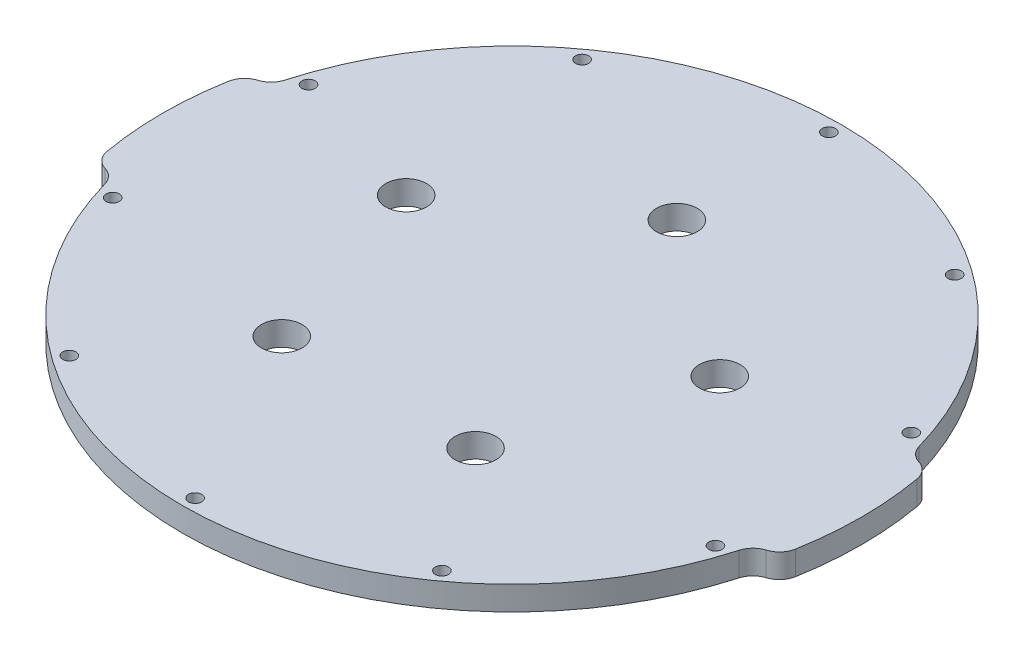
ISO-10303-21;
HEADER;
FILE_DESCRIPTION(('STEP AP214'),'2;1');
FILE_NAME('part.step','',(''),(''),'','','');
FILE_SCHEMA(('AUTOMOTIVE_DESIGN { 1 0 10303 214 1 1 1 1 }'));
ENDSEC;
DATA;
#1=APPLICATION_CONTEXT('core data for automotive mechanical design processes');
#2=APPLICATION_PROTOCOL_DEFINITION('international standard','automotive_design',2000,#1);
#3=PRODUCT_CONTEXT('',#1,'mechanical');
#4=PRODUCT('Part','Part','',(#3));
#5=PRODUCT_RELATED_PRODUCT_CATEGORY('part','',(#4));
#6=PRODUCT_DEFINITION_FORMATION('','',#4);
#7=PRODUCT_DEFINITION_CONTEXT('part definition',#1,'design');
#8=PRODUCT_DEFINITION('design','',#6,#7);
#9=PRODUCT_DEFINITION_SHAPE('','',#8);
#10=(LENGTH_UNIT() NAMED_UNIT(*) SI_UNIT(.MILLI.,.METRE.));
#11=(NAMED_UNIT(*) PLANE_ANGLE_UNIT() SI_UNIT($,.RADIAN.));
#12=(NAMED_UNIT(*) SI_UNIT($,.STERADIAN.) SOLID_ANGLE_UNIT());
#13=UNCERTAINTY_MEASURE_WITH_UNIT(LENGTH_MEASURE(1.E-05),#10,'distance_accuracy_value','');
#14=(GEOMETRIC_REPRESENTATION_CONTEXT(3) GLOBAL_UNCERTAINTY_ASSIGNED_CONTEXT((#13)) GLOBAL_UNIT_ASSIGNED_CONTEXT((#10,
#11,#12)) REPRESENTATION_CONTEXT('',''));
#15=CARTESIAN_POINT('',(0.,0.,0.));
#16=DIRECTION('',(0.,0.,1.));
#17=DIRECTION('',(1.,0.,0.));
#18=AXIS2_PLACEMENT_3D('',#15,#16,#17);
#19=CARTESIAN_POINT('',(-40.6479400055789,6.,-7.16732853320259));
#20=DIRECTION('',(0.,-1.,0.));
#21=DIRECTION('',(0.,0.,-1.));
#22=AXIS2_PLACEMENT_3D('',#19,#20,#21);
#23=PLANE('',#22);
#24=CARTESIAN_POINT('',(-39.2548577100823,6.,-12.7546764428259));
#25=DIRECTION('',(0.,1.,0.));
#26=DIRECTION('',(0.,0.,1.));
#27=AXIS2_PLACEMENT_3D('',#24,#25,#26);
#28=CIRCLE('',#27,5.1);
#29=CARTESIAN_POINT('',(-39.2548577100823,6.,-7.65467644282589));
#30=VERTEX_POINT('',#29);
#31=EDGE_CURVE('E384',#30,#30,#28,.T.);
#32=ORIENTED_EDGE('',*,*,#31,.F.);
#33=EDGE_LOOP('',(#32));
#34=FACE_BOUND('',#33,.T.);
#35=CARTESIAN_POINT('',(-24.2608362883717,6.,33.3921764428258));
#36=DIRECTION('',(0.,1.,0.));
#37=DIRECTION('',(0.,0.,1.));
#38=AXIS2_PLACEMENT_3D('',#35,#36,#37);
#39=CIRCLE('',#38,5.1);
#40=CARTESIAN_POINT('',(-24.2608362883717,6.,38.4921764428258));
#41=VERTEX_POINT('',#40);
#42=EDGE_CURVE('E378',#41,#41,#39,.T.);
#43=ORIENTED_EDGE('',*,*,#42,.F.);
#44=EDGE_LOOP('',(#43));
#45=FACE_BOUND('',#44,.T.);
#46=CARTESIAN_POINT('',(24.2608362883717,6.,33.3921764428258));
#47=DIRECTION('',(0.,1.,0.));
#48=DIRECTION('',(0.,0.,1.));
#49=AXIS2_PLACEMENT_3D('',#46,#47,#48);
#50=CIRCLE('',#49,5.1);
#51=CARTESIAN_POINT('',(24.2608362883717,6.,38.4921764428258));
#52=VERTEX_POINT('',#51);
#53=EDGE_CURVE('E372',#52,#52,#50,.T.);
#54=ORIENTED_EDGE('',*,*,#53,.F.);
#55=EDGE_LOOP('',(#54));
#56=FACE_BOUND('',#55,.T.);
#57=CARTESIAN_POINT('',(39.2548577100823,6.,-12.7546764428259));
#58=DIRECTION('',(0.,1.,0.));
#59=DIRECTION('',(0.,0.,1.));
#60=AXIS2_PLACEMENT_3D('',#57,#58,#59);
#61=CIRCLE('',#60,5.09999999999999);
#62=CARTESIAN_POINT('',(39.2548577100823,6.,-7.65467644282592));
#63=VERTEX_POINT('',#62);
#64=EDGE_CURVE('E366',#63,#63,#61,.T.);
#65=ORIENTED_EDGE('',*,*,#64,.F.);
#66=EDGE_LOOP('',(#65));
#67=FACE_BOUND('',#66,.T.);
#68=CARTESIAN_POINT('',(0.,6.,-41.2749999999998));
#69=DIRECTION('',(0.,1.,0.));
#70=DIRECTION('',(0.,0.,1.));
#71=AXIS2_PLACEMENT_3D('',#68,#69,#70);
#72=CIRCLE('',#71,5.1);
#73=CARTESIAN_POINT('',(0.,6.,-36.1749999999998));
#74=VERTEX_POINT('',#73);
#75=EDGE_CURVE('E360',#74,#74,#72,.T.);
#76=ORIENTED_EDGE('',*,*,#75,.F.);
#77=EDGE_LOOP('',(#76));
#78=FACE_BOUND('',#77,.T.);
#79=CARTESIAN_POINT('',(-75.4663345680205,6.,-24.5204985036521));
#80=DIRECTION('',(0.,1.,0.));
#81=DIRECTION('',(0.,0.,1.));
#82=AXIS2_PLACEMENT_3D('',#79,#80,#81);
#83=CIRCLE('',#82,1.6500000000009);
#84=CARTESIAN_POINT('',(-75.4663345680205,6.,-22.8704985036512));
#85=VERTEX_POINT('',#84);
#86=EDGE_CURVE('E345',#85,#85,#83,.T.);
#87=ORIENTED_EDGE('',*,*,#86,.F.);
#88=EDGE_LOOP('',(#87));
#89=FACE_BOUND('',#88,.T.);
#90=CARTESIAN_POINT('',(-46.6407597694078,6.,64.1954985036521));
#91=DIRECTION('',(0.,1.,0.));
#92=DIRECTION('',(0.,0.,1.));
#93=AXIS2_PLACEMENT_3D('',#90,#91,#92);
#94=CIRCLE('',#93,1.65000000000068);
#95=CARTESIAN_POINT('',(-46.6407597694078,6.,65.8454985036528));
#96=VERTEX_POINT('',#95);
#97=EDGE_CURVE('E333',#96,#96,#94,.T.);
#98=ORIENTED_EDGE('',*,*,#97,.F.);
#99=EDGE_LOOP('',(#98));
#100=FACE_BOUND('',#99,.T.);
#101=CARTESIAN_POINT('',(46.6407597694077,6.,64.1954985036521));
#102=DIRECTION('',(0.,1.,0.));
#103=DIRECTION('',(0.,0.,1.));
#104=AXIS2_PLACEMENT_3D('',#101,#102,#103);
#105=CIRCLE('',#104,1.65000000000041);
#106=CARTESIAN_POINT('',(46.6407597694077,6.,65.8454985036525));
#107=VERTEX_POINT('',#106);
#108=EDGE_CURVE('E321',#107,#107,#105,.T.);
#109=ORIENTED_EDGE('',*,*,#108,.F.);
#110=EDGE_LOOP('',(#109));
#111=FACE_BOUND('',#110,.T.);
#112=CARTESIAN_POINT('',(75.4663345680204,6.,-24.5204985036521));
#113=DIRECTION('',(0.,1.,0.));
#114=DIRECTION('',(0.,0.,1.));
#115=AXIS2_PLACEMENT_3D('',#112,#113,#114);
#116=CIRCLE('',#115,1.65000000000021);
#117=CARTESIAN_POINT('',(75.4663345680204,6.,-22.8704985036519));
#118=VERTEX_POINT('',#117);
#119=EDGE_CURVE('E309',#118,#118,#116,.T.);
#120=ORIENTED_EDGE('',*,*,#119,.F.);
#121=EDGE_LOOP('',(#120));
#122=FACE_BOUND('',#121,.T.);
#123=CARTESIAN_POINT('',(0.,6.,-79.35));
#124=DIRECTION('',(0.,1.,0.));
#125=DIRECTION('',(0.,0.,1.));
#126=AXIS2_PLACEMENT_3D('',#123,#124,#125);
#127=CIRCLE('',#126,1.65);
#128=CARTESIAN_POINT('',(0.,6.,-77.7));
#129=VERTEX_POINT('',#128);
#130=EDGE_CURVE('E277',#129,#129,#127,.T.);
#131=ORIENTED_EDGE('',*,*,#130,.F.);
#132=EDGE_LOOP('',(#131));
#133=FACE_BOUND('',#132,.T.);
#134=CARTESIAN_POINT('',(0.,6.,0.));
#135=DIRECTION('',(0.,1.,0.));
#136=DIRECTION('',(0.,0.,-1.));
#137=AXIS2_PLACEMENT_3D('',#134,#135,#136);
#138=CIRCLE('',#137,82.55);
#139=CARTESIAN_POINT('',(79.4156922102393,6.,-22.5310969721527));
#140=VERTEX_POINT('',#139);
#141=CARTESIAN_POINT('',(-79.4156922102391,6.,-22.531096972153));
#142=VERTEX_POINT('',#141);
#143=EDGE_CURVE('E272',#140,#142,#138,.T.);
#144=ORIENTED_EDGE('',*,*,#143,.T.);
#145=CARTESIAN_POINT('',(-84.2258492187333,6.,-23.8957909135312));
#146=DIRECTION('',(0.,-1.,0.));
#147=DIRECTION('',(0.,0.,-1.));
#148=AXIS2_PLACEMENT_3D('',#145,#146,#147);
#149=CIRCLE('',#148,5.);
#150=CARTESIAN_POINT('',(-82.7608646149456,6.,-19.1152239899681));
#151=VERTEX_POINT('',#150);
#152=EDGE_CURVE('E127',#142,#151,#149,.T.);
#153=ORIENTED_EDGE('',*,*,#152,.T.);
#154=CARTESIAN_POINT('',(-81.2958800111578,6.,-14.3346570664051));
#155=DIRECTION('',(0.,1.,0.));
#156=DIRECTION('',(0.,0.,-1.));
#157=AXIS2_PLACEMENT_3D('',#154,#155,#156);
#158=CIRCLE('',#157,5.00000000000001);
#159=CARTESIAN_POINT('',(-86.2199187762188,6.,-15.2028979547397));
#160=VERTEX_POINT('',#159);
#161=EDGE_CURVE('E120',#151,#160,#158,.T.);
#162=ORIENTED_EDGE('',*,*,#161,.T.);
#163=CARTESIAN_POINT('',(0.,6.,0.));
#164=DIRECTION('',(0.,1.,0.));
#165=DIRECTION('',(0.,0.,-1.));
#166=AXIS2_PLACEMENT_3D('',#163,#164,#165);
#167=CIRCLE('',#166,87.55);
#168=CARTESIAN_POINT('',(-86.2199187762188,6.,15.2028979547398));
#169=VERTEX_POINT('',#168);
#170=EDGE_CURVE('E124',#160,#169,#167,.T.);
#171=ORIENTED_EDGE('',*,*,#170,.T.);
#172=CARTESIAN_POINT('',(-81.2958800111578,6.,14.3346570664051));
#173=DIRECTION('',(0.,1.,0.));
#174=DIRECTION('',(0.,0.,1.));
#175=AXIS2_PLACEMENT_3D('',#172,#173,#174);
#176=CIRCLE('',#175,5.00000000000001);
#177=CARTESIAN_POINT('',(-82.7608646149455,6.,19.1152239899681));
#178=VERTEX_POINT('',#177);
#179=EDGE_CURVE('E140',#169,#178,#176,.T.);
#180=ORIENTED_EDGE('',*,*,#179,.T.);
#181=CARTESIAN_POINT('',(-84.2258492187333,6.,23.8957909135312));
#182=DIRECTION('',(0.,-1.,0.));
#183=DIRECTION('',(0.,0.,-1.));
#184=AXIS2_PLACEMENT_3D('',#181,#182,#183);
#185=CIRCLE('',#184,5.);
#186=CARTESIAN_POINT('',(-79.4156922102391,6.,22.531096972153));
#187=VERTEX_POINT('',#186);
#188=EDGE_CURVE('E11',#178,#187,#185,.T.);
#189=ORIENTED_EDGE('',*,*,#188,.T.);
#190=CARTESIAN_POINT('',(0.,6.,-4.92661467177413E-13));
#191=DIRECTION('',(0.,1.,0.));
#192=DIRECTION('',(0.,0.,-1.));
#193=AXIS2_PLACEMENT_3D('',#190,#191,#192);
#194=CIRCLE('',#193,82.5500000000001);
#195=CARTESIAN_POINT('',(79.4156922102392,6.,22.5310969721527));
#196=VERTEX_POINT('',#195);
#197=EDGE_CURVE('E259',#187,#196,#194,.T.);
#198=ORIENTED_EDGE('',*,*,#197,.T.);
#199=CARTESIAN_POINT('',(84.2258492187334,6.,23.8957909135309));
#200=DIRECTION('',(0.,-1.,0.));
#201=DIRECTION('',(0.,0.,-1.));
#202=AXIS2_PLACEMENT_3D('',#199,#200,#201);
#203=CIRCLE('',#202,5.);
#204=CARTESIAN_POINT('',(82.7608646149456,6.,19.1152239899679));
#205=VERTEX_POINT('',#204);
#206=EDGE_CURVE('E171',#196,#205,#203,.T.);
#207=ORIENTED_EDGE('',*,*,#206,.T.);
#208=CARTESIAN_POINT('',(81.2958800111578,6.,14.3346570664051));
#209=DIRECTION('',(0.,1.,0.));
#210=DIRECTION('',(0.,0.,-1.));
#211=AXIS2_PLACEMENT_3D('',#208,#209,#210);
#212=CIRCLE('',#211,4.99999999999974);
#213=CARTESIAN_POINT('',(86.2199187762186,6.,15.2028979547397));
#214=VERTEX_POINT('',#213);
#215=EDGE_CURVE('E256',#205,#214,#212,.T.);
#216=ORIENTED_EDGE('',*,*,#215,.T.);
#217=CARTESIAN_POINT('',(-1.29063426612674E-12,6.,0.));
#218=DIRECTION('',(0.,1.,0.));
#219=DIRECTION('',(0.,0.,1.));
#220=AXIS2_PLACEMENT_3D('',#217,#218,#219);
#221=CIRCLE('',#220,87.550000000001);
#222=CARTESIAN_POINT('',(86.2199187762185,6.,-15.2028979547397));
#223=VERTEX_POINT('',#222);
#224=EDGE_CURVE('E263',#214,#223,#221,.T.);
#225=ORIENTED_EDGE('',*,*,#224,.T.);
#226=CARTESIAN_POINT('',(81.2958800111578,6.,-14.3346570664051));
#227=DIRECTION('',(0.,1.,0.));
#228=DIRECTION('',(0.,0.,1.));
#229=AXIS2_PLACEMENT_3D('',#226,#227,#228);
#230=CIRCLE('',#229,4.99999999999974);
#231=CARTESIAN_POINT('',(82.7608646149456,6.,-19.1152239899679));
#232=VERTEX_POINT('',#231);
#233=EDGE_CURVE('E265',#223,#232,#230,.T.);
#234=ORIENTED_EDGE('',*,*,#233,.T.);
#235=CARTESIAN_POINT('',(84.2258492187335,6.,-23.8957909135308));
#236=DIRECTION('',(0.,-1.,0.));
#237=DIRECTION('',(0.,0.,-1.));
#238=AXIS2_PLACEMENT_3D('',#235,#236,#237);
#239=CIRCLE('',#238,5.);
#240=EDGE_CURVE('E175',#232,#140,#239,.T.);
#241=ORIENTED_EDGE('',*,*,#240,.T.);
#242=EDGE_LOOP('',(#144,#153,#162,#171,#180,#189,#198,#207,#216,#225,#234,#241));
#243=FACE_BOUND('',#242,.T.);
#244=CARTESIAN_POINT('',(46.6407597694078,6.,-64.1954985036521));
#245=DIRECTION('',(0.,1.,0.));
#246=DIRECTION('',(0.,0.,1.));
#247=AXIS2_PLACEMENT_3D('',#244,#245,#246);
#248=CIRCLE('',#247,1.65000000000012);
#249=CARTESIAN_POINT('',(46.6407597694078,6.,-62.5454985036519));
#250=VERTEX_POINT('',#249);
#251=EDGE_CURVE('E303',#250,#250,#248,.T.);
#252=ORIENTED_EDGE('',*,*,#251,.F.);
#253=EDGE_LOOP('',(#252));
#254=FACE_BOUND('',#253,.T.);
#255=CARTESIAN_POINT('',(75.4663345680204,6.,24.5204985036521));
#256=DIRECTION('',(0.,1.,0.));
#257=DIRECTION('',(0.,0.,1.));
#258=AXIS2_PLACEMENT_3D('',#255,#256,#257);
#259=CIRCLE('',#258,1.65000000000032);
#260=CARTESIAN_POINT('',(75.4663345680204,6.,26.1704985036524));
#261=VERTEX_POINT('',#260);
#262=EDGE_CURVE('E315',#261,#261,#259,.T.);
#263=ORIENTED_EDGE('',*,*,#262,.F.);
#264=EDGE_LOOP('',(#263));
#265=FACE_BOUND('',#264,.T.);
#266=CARTESIAN_POINT('',(0.,6.,79.35));
#267=DIRECTION('',(0.,1.,0.));
#268=DIRECTION('',(0.,0.,1.));
#269=AXIS2_PLACEMENT_3D('',#266,#267,#268);
#270=CIRCLE('',#269,1.65000000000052);
#271=CARTESIAN_POINT('',(0.,6.,81.0000000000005));
#272=VERTEX_POINT('',#271);
#273=EDGE_CURVE('E327',#272,#272,#270,.T.);
#274=ORIENTED_EDGE('',*,*,#273,.F.);
#275=EDGE_LOOP('',(#274));
#276=FACE_BOUND('',#275,.T.);
#277=CARTESIAN_POINT('',(-75.4663345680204,6.,24.5204985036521));
#278=DIRECTION('',(0.,1.,0.));
#279=DIRECTION('',(0.,0.,1.));
#280=AXIS2_PLACEMENT_3D('',#277,#278,#279);
#281=CIRCLE('',#280,1.65000000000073);
#282=CARTESIAN_POINT('',(-75.4663345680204,6.,26.1704985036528));
#283=VERTEX_POINT('',#282);
#284=EDGE_CURVE('E339',#283,#283,#281,.T.);
#285=ORIENTED_EDGE('',*,*,#284,.F.);
#286=EDGE_LOOP('',(#285));
#287=FACE_BOUND('',#286,.T.);
#288=CARTESIAN_POINT('',(-46.6407597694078,6.,-64.1954985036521));
#289=DIRECTION('',(0.,1.,0.));
#290=DIRECTION('',(0.,0.,1.));
#291=AXIS2_PLACEMENT_3D('',#288,#289,#290);
#292=CIRCLE('',#291,1.65000000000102);
#293=CARTESIAN_POINT('',(-46.6407597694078,6.,-62.545498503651));
#294=VERTEX_POINT('',#293);
#295=EDGE_CURVE('E351',#294,#294,#292,.T.);
#296=ORIENTED_EDGE('',*,*,#295,.F.);
#297=EDGE_LOOP('',(#296));
#298=FACE_BOUND('',#297,.T.);
#299=ADVANCED_FACE('F32',(#34,#45,#56,#67,#78,#89,#100,#111,#122,#133,#243,#254,#265,#276,#287,
#298),#23,.F.);
#300=CARTESIAN_POINT('',(-40.6479400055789,0.,-7.16732853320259));
#301=DIRECTION('',(0.,-1.,0.));
#302=DIRECTION('',(0.,0.,-1.));
#303=AXIS2_PLACEMENT_3D('',#300,#301,#302);
#304=PLANE('',#303);
#305=CARTESIAN_POINT('',(-39.2548577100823,0.,-12.7546764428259));
#306=DIRECTION('',(0.,1.,0.));
#307=DIRECTION('',(0.,0.,1.));
#308=AXIS2_PLACEMENT_3D('',#305,#306,#307);
#309=CIRCLE('',#308,5.1);
#310=CARTESIAN_POINT('',(-39.2548577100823,0.,-7.65467644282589));
#311=VERTEX_POINT('',#310);
#312=EDGE_CURVE('E381',#311,#311,#309,.T.);
#313=ORIENTED_EDGE('',*,*,#312,.T.);
#314=EDGE_LOOP('',(#313));
#315=FACE_BOUND('',#314,.T.);
#316=CARTESIAN_POINT('',(-24.2608362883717,0.,33.3921764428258));
#317=DIRECTION('',(0.,1.,0.));
#318=DIRECTION('',(0.,0.,1.));
#319=AXIS2_PLACEMENT_3D('',#316,#317,#318);
#320=CIRCLE('',#319,5.1);
#321=CARTESIAN_POINT('',(-24.2608362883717,0.,38.4921764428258));
#322=VERTEX_POINT('',#321);
#323=EDGE_CURVE('E375',#322,#322,#320,.T.);
#324=ORIENTED_EDGE('',*,*,#323,.T.);
#325=EDGE_LOOP('',(#324));
#326=FACE_BOUND('',#325,.T.);
#327=CARTESIAN_POINT('',(24.2608362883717,0.,33.3921764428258));
#328=DIRECTION('',(0.,1.,0.));
#329=DIRECTION('',(0.,0.,1.));
#330=AXIS2_PLACEMENT_3D('',#327,#328,#329);
#331=CIRCLE('',#330,5.1);
#332=CARTESIAN_POINT('',(24.2608362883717,0.,38.4921764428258));
#333=VERTEX_POINT('',#332);
#334=EDGE_CURVE('E369',#333,#333,#331,.T.);
#335=ORIENTED_EDGE('',*,*,#334,.T.);
#336=EDGE_LOOP('',(#335));
#337=FACE_BOUND('',#336,.T.);
#338=CARTESIAN_POINT('',(39.2548577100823,0.,-12.7546764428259));
#339=DIRECTION('',(0.,1.,0.));
#340=DIRECTION('',(0.,0.,1.));
#341=AXIS2_PLACEMENT_3D('',#338,#339,#340);
#342=CIRCLE('',#341,5.09999999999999);
#343=CARTESIAN_POINT('',(39.2548577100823,0.,-7.65467644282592));
#344=VERTEX_POINT('',#343);
#345=EDGE_CURVE('E363',#344,#344,#342,.T.);
#346=ORIENTED_EDGE('',*,*,#345,.T.);
#347=EDGE_LOOP('',(#346));
#348=FACE_BOUND('',#347,.T.);
#349=CARTESIAN_POINT('',(0.,0.,-41.2749999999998));
#350=DIRECTION('',(0.,1.,0.));
#351=DIRECTION('',(0.,0.,1.));
#352=AXIS2_PLACEMENT_3D('',#349,#350,#351);
#353=CIRCLE('',#352,5.1);
#354=CARTESIAN_POINT('',(0.,0.,-36.1749999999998));
#355=VERTEX_POINT('',#354);
#356=EDGE_CURVE('E357',#355,#355,#353,.T.);
#357=ORIENTED_EDGE('',*,*,#356,.T.);
#358=EDGE_LOOP('',(#357));
#359=FACE_BOUND('',#358,.T.);
#360=CARTESIAN_POINT('',(-75.4663345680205,0.,-24.5204985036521));
#361=DIRECTION('',(0.,1.,0.));
#362=DIRECTION('',(0.,0.,1.));
#363=AXIS2_PLACEMENT_3D('',#360,#361,#362);
#364=CIRCLE('',#363,1.6500000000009);
#365=CARTESIAN_POINT('',(-75.4663345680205,0.,-22.8704985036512));
#366=VERTEX_POINT('',#365);
#367=EDGE_CURVE('E348',#366,#366,#364,.T.);
#368=ORIENTED_EDGE('',*,*,#367,.T.);
#369=EDGE_LOOP('',(#368));
#370=FACE_BOUND('',#369,.T.);
#371=CARTESIAN_POINT('',(-46.6407597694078,0.,64.1954985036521));
#372=DIRECTION('',(0.,1.,0.));
#373=DIRECTION('',(0.,0.,1.));
#374=AXIS2_PLACEMENT_3D('',#371,#372,#373);
#375=CIRCLE('',#374,1.65000000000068);
#376=CARTESIAN_POINT('',(-46.6407597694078,0.,65.8454985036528));
#377=VERTEX_POINT('',#376);
#378=EDGE_CURVE('E336',#377,#377,#375,.T.);
#379=ORIENTED_EDGE('',*,*,#378,.T.);
#380=EDGE_LOOP('',(#379));
#381=FACE_BOUND('',#380,.T.);
#382=CARTESIAN_POINT('',(46.6407597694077,0.,64.1954985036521));
#383=DIRECTION('',(0.,1.,0.));
#384=DIRECTION('',(0.,0.,1.));
#385=AXIS2_PLACEMENT_3D('',#382,#383,#384);
#386=CIRCLE('',#385,1.65000000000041);
#387=CARTESIAN_POINT('',(46.6407597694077,0.,65.8454985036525));
#388=VERTEX_POINT('',#387);
#389=EDGE_CURVE('E324',#388,#388,#386,.T.);
#390=ORIENTED_EDGE('',*,*,#389,.T.);
#391=EDGE_LOOP('',(#390));
#392=FACE_BOUND('',#391,.T.);
#393=CARTESIAN_POINT('',(75.4663345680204,0.,-24.5204985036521));
#394=DIRECTION('',(0.,1.,0.));
#395=DIRECTION('',(0.,0.,1.));
#396=AXIS2_PLACEMENT_3D('',#393,#394,#395);
#397=CIRCLE('',#396,1.65000000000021);
#398=CARTESIAN_POINT('',(75.4663345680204,0.,-22.8704985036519));
#399=VERTEX_POINT('',#398);
#400=EDGE_CURVE('E312',#399,#399,#397,.T.);
#401=ORIENTED_EDGE('',*,*,#400,.T.);
#402=EDGE_LOOP('',(#401));
#403=FACE_BOUND('',#402,.T.);
#404=CARTESIAN_POINT('',(0.,0.,-79.35));
#405=DIRECTION('',(0.,1.,0.));
#406=DIRECTION('',(0.,0.,1.));
#407=AXIS2_PLACEMENT_3D('',#404,#405,#406);
#408=CIRCLE('',#407,1.65);
#409=CARTESIAN_POINT('',(0.,0.,-77.7));
#410=VERTEX_POINT('',#409);
#411=EDGE_CURVE('E300',#410,#410,#408,.T.);
#412=ORIENTED_EDGE('',*,*,#411,.T.);
#413=EDGE_LOOP('',(#412));
#414=FACE_BOUND('',#413,.T.);
#415=CARTESIAN_POINT('',(-81.2958800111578,0.,-14.3346570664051));
#416=DIRECTION('',(0.,1.,0.));
#417=DIRECTION('',(0.,0.,-1.));
#418=AXIS2_PLACEMENT_3D('',#415,#416,#417);
#419=CIRCLE('',#418,5.00000000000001);
#420=CARTESIAN_POINT('',(-82.7608646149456,0.,-19.1152239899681));
#421=VERTEX_POINT('',#420);
#422=CARTESIAN_POINT('',(-86.2199187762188,0.,-15.2028979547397));
#423=VERTEX_POINT('',#422);
#424=EDGE_CURVE('E144',#421,#423,#419,.T.);
#425=ORIENTED_EDGE('',*,*,#424,.F.);
#426=CARTESIAN_POINT('',(-84.2258492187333,0.,-23.8957909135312));
#427=DIRECTION('',(0.,-1.,0.));
#428=DIRECTION('',(0.,0.,-1.));
#429=AXIS2_PLACEMENT_3D('',#426,#427,#428);
#430=CIRCLE('',#429,5.);
#431=CARTESIAN_POINT('',(-79.4156922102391,0.,-22.531096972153));
#432=VERTEX_POINT('',#431);
#433=EDGE_CURVE('E177',#421,#432,#430,.F.);
#434=ORIENTED_EDGE('',*,*,#433,.T.);
#435=CARTESIAN_POINT('',(0.,0.,0.));
#436=DIRECTION('',(0.,1.,0.));
#437=DIRECTION('',(0.,0.,-1.));
#438=AXIS2_PLACEMENT_3D('',#435,#436,#437);
#439=CIRCLE('',#438,82.55);
#440=CARTESIAN_POINT('',(79.4156922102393,0.,-22.5310969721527));
#441=VERTEX_POINT('',#440);
#442=EDGE_CURVE('E132',#441,#432,#439,.T.);
#443=ORIENTED_EDGE('',*,*,#442,.F.);
#444=CARTESIAN_POINT('',(84.2258492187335,0.,-23.8957909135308));
#445=DIRECTION('',(0.,-1.,0.));
#446=DIRECTION('',(0.,0.,-1.));
#447=AXIS2_PLACEMENT_3D('',#444,#445,#446);
#448=CIRCLE('',#447,5.);
#449=CARTESIAN_POINT('',(82.7608646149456,0.,-19.1152239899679));
#450=VERTEX_POINT('',#449);
#451=EDGE_CURVE('E173',#441,#450,#448,.F.);
#452=ORIENTED_EDGE('',*,*,#451,.T.);
#453=CARTESIAN_POINT('',(81.2958800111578,0.,-14.3346570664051));
#454=DIRECTION('',(0.,1.,0.));
#455=DIRECTION('',(0.,0.,1.));
#456=AXIS2_PLACEMENT_3D('',#453,#454,#455);
#457=CIRCLE('',#456,4.99999999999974);
#458=CARTESIAN_POINT('',(86.2199187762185,0.,-15.2028979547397));
#459=VERTEX_POINT('',#458);
#460=EDGE_CURVE('E189',#459,#450,#457,.T.);
#461=ORIENTED_EDGE('',*,*,#460,.F.);
#462=CARTESIAN_POINT('',(-1.29063426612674E-12,0.,0.));
#463=DIRECTION('',(0.,1.,0.));
#464=DIRECTION('',(0.,0.,1.));
#465=AXIS2_PLACEMENT_3D('',#462,#463,#464);
#466=CIRCLE('',#465,87.550000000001);
#467=CARTESIAN_POINT('',(86.2199187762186,0.,15.2028979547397));
#468=VERTEX_POINT('',#467);
#469=EDGE_CURVE('E286',#468,#459,#466,.T.);
#470=ORIENTED_EDGE('',*,*,#469,.F.);
#471=CARTESIAN_POINT('',(81.2958800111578,0.,14.3346570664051));
#472=DIRECTION('',(0.,1.,0.));
#473=DIRECTION('',(0.,0.,-1.));
#474=AXIS2_PLACEMENT_3D('',#471,#472,#473);
#475=CIRCLE('',#474,4.99999999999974);
#476=CARTESIAN_POINT('',(82.7608646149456,0.,19.1152239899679));
#477=VERTEX_POINT('',#476);
#478=EDGE_CURVE('E284',#477,#468,#475,.T.);
#479=ORIENTED_EDGE('',*,*,#478,.F.);
#480=CARTESIAN_POINT('',(84.2258492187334,0.,23.8957909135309));
#481=DIRECTION('',(0.,-1.,0.));
#482=DIRECTION('',(0.,0.,-1.));
#483=AXIS2_PLACEMENT_3D('',#480,#481,#482);
#484=CIRCLE('',#483,5.);
#485=CARTESIAN_POINT('',(79.4156922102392,0.,22.5310969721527));
#486=VERTEX_POINT('',#485);
#487=EDGE_CURVE('E169',#477,#486,#484,.F.);
#488=ORIENTED_EDGE('',*,*,#487,.T.);
#489=CARTESIAN_POINT('',(0.,0.,-4.92661467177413E-13));
#490=DIRECTION('',(0.,1.,0.));
#491=DIRECTION('',(0.,0.,-1.));
#492=AXIS2_PLACEMENT_3D('',#489,#490,#491);
#493=CIRCLE('',#492,82.5500000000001);
#494=CARTESIAN_POINT('',(-79.4156922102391,0.,22.531096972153));
#495=VERTEX_POINT('',#494);
#496=EDGE_CURVE('E281',#495,#486,#493,.T.);
#497=ORIENTED_EDGE('',*,*,#496,.F.);
#498=CARTESIAN_POINT('',(-84.2258492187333,0.,23.8957909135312));
#499=DIRECTION('',(0.,-1.,0.));
#500=DIRECTION('',(0.,0.,-1.));
#501=AXIS2_PLACEMENT_3D('',#498,#499,#500);
#502=CIRCLE('',#501,5.);
#503=CARTESIAN_POINT('',(-82.7608646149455,0.,19.1152239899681));
#504=VERTEX_POINT('',#503);
#505=EDGE_CURVE('E40',#495,#504,#502,.F.);
#506=ORIENTED_EDGE('',*,*,#505,.T.);
#507=CARTESIAN_POINT('',(-81.2958800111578,0.,14.3346570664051));
#508=DIRECTION('',(0.,1.,0.));
#509=DIRECTION('',(0.,0.,1.));
#510=AXIS2_PLACEMENT_3D('',#507,#508,#509);
#511=CIRCLE('',#510,5.00000000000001);
#512=CARTESIAN_POINT('',(-86.2199187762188,0.,15.2028979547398));
#513=VERTEX_POINT('',#512);
#514=EDGE_CURVE('E279',#513,#504,#511,.T.);
#515=ORIENTED_EDGE('',*,*,#514,.F.);
#516=CARTESIAN_POINT('',(0.,0.,0.));
#517=DIRECTION('',(0.,1.,0.));
#518=DIRECTION('',(0.,0.,-1.));
#519=AXIS2_PLACEMENT_3D('',#516,#517,#518);
#520=CIRCLE('',#519,87.55);
#521=EDGE_CURVE('E276',#423,#513,#520,.T.);
#522=ORIENTED_EDGE('',*,*,#521,.F.);
#523=EDGE_LOOP('',(#425,#434,#443,#452,#461,#470,#479,#488,#497,#506,#515,#522));
#524=FACE_BOUND('',#523,.T.);
#525=CARTESIAN_POINT('',(46.6407597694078,0.,-64.1954985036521));
#526=DIRECTION('',(0.,1.,0.));
#527=DIRECTION('',(0.,0.,1.));
#528=AXIS2_PLACEMENT_3D('',#525,#526,#527);
#529=CIRCLE('',#528,1.65000000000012);
#530=CARTESIAN_POINT('',(46.6407597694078,0.,-62.5454985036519));
#531=VERTEX_POINT('',#530);
#532=EDGE_CURVE('E306',#531,#531,#529,.T.);
#533=ORIENTED_EDGE('',*,*,#532,.T.);
#534=EDGE_LOOP('',(#533));
#535=FACE_BOUND('',#534,.T.);
#536=CARTESIAN_POINT('',(75.4663345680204,0.,24.5204985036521));
#537=DIRECTION('',(0.,1.,0.));
#538=DIRECTION('',(0.,0.,1.));
#539=AXIS2_PLACEMENT_3D('',#536,#537,#538);
#540=CIRCLE('',#539,1.65000000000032);
#541=CARTESIAN_POINT('',(75.4663345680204,0.,26.1704985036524));
#542=VERTEX_POINT('',#541);
#543=EDGE_CURVE('E318',#542,#542,#540,.T.);
#544=ORIENTED_EDGE('',*,*,#543,.T.);
#545=EDGE_LOOP('',(#544));
#546=FACE_BOUND('',#545,.T.);
#547=CARTESIAN_POINT('',(0.,0.,79.35));
#548=DIRECTION('',(0.,1.,0.));
#549=DIRECTION('',(0.,0.,1.));
#550=AXIS2_PLACEMENT_3D('',#547,#548,#549);
#551=CIRCLE('',#550,1.65000000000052);
#552=CARTESIAN_POINT('',(0.,0.,81.0000000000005));
#553=VERTEX_POINT('',#552);
#554=EDGE_CURVE('E330',#553,#553,#551,.T.);
#555=ORIENTED_EDGE('',*,*,#554,.T.);
#556=EDGE_LOOP('',(#555));
#557=FACE_BOUND('',#556,.T.);
#558=CARTESIAN_POINT('',(-75.4663345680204,0.,24.5204985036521));
#559=DIRECTION('',(0.,1.,0.));
#560=DIRECTION('',(0.,0.,1.));
#561=AXIS2_PLACEMENT_3D('',#558,#559,#560);
#562=CIRCLE('',#561,1.65000000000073);
#563=CARTESIAN_POINT('',(-75.4663345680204,0.,26.1704985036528));
#564=VERTEX_POINT('',#563);
#565=EDGE_CURVE('E342',#564,#564,#562,.T.);
#566=ORIENTED_EDGE('',*,*,#565,.T.);
#567=EDGE_LOOP('',(#566));
#568=FACE_BOUND('',#567,.T.);
#569=CARTESIAN_POINT('',(-46.6407597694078,0.,-64.1954985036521));
#570=DIRECTION('',(0.,1.,0.));
#571=DIRECTION('',(0.,0.,1.));
#572=AXIS2_PLACEMENT_3D('',#569,#570,#571);
#573=CIRCLE('',#572,1.65000000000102);
#574=CARTESIAN_POINT('',(-46.6407597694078,0.,-62.545498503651));
#575=VERTEX_POINT('',#574);
#576=EDGE_CURVE('E354',#575,#575,#573,.T.);
#577=ORIENTED_EDGE('',*,*,#576,.T.);
#578=EDGE_LOOP('',(#577));
#579=FACE_BOUND('',#578,.T.);
#580=ADVANCED_FACE('F181',(#315,#326,#337,#348,#359,#370,#381,#392,#403,#414,#524,#535,#546,
#557,#568,#579),#304,.T.);
#581=CARTESIAN_POINT('',(-81.2958800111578,6.,-14.3346570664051));
#582=DIRECTION('',(0.,-1.,0.));
#583=DIRECTION('',(0.,0.,-1.));
#584=AXIS2_PLACEMENT_3D('',#581,#582,#583);
#585=CYLINDRICAL_SURFACE('',#584,5.00000000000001);
#586=ORIENTED_EDGE('',*,*,#161,.F.);
#587=DIRECTION('',(0.,-1.,0.));
#588=VECTOR('',#587,1.);
#589=CARTESIAN_POINT('',(-82.7608646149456,6.,-19.1152239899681));
#590=LINE('',#589,#588);
#591=EDGE_CURVE('E166',#151,#421,#590,.T.);
#592=ORIENTED_EDGE('',*,*,#591,.T.);
#593=ORIENTED_EDGE('',*,*,#424,.T.);
#594=DIRECTION('',(0.,-1.,0.));
#595=VECTOR('',#594,1.);
#596=CARTESIAN_POINT('',(-86.2199187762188,6.,-15.2028979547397));
#597=LINE('',#596,#595);
#598=EDGE_CURVE('E137',#160,#423,#597,.T.);
#599=ORIENTED_EDGE('',*,*,#598,.F.);
#600=EDGE_LOOP('',(#586,#592,#593,#599));
#601=FACE_BOUND('',#600,.T.);
#602=ADVANCED_FACE('F142',(#601),#585,.T.);
#603=CARTESIAN_POINT('',(0.,6.,0.));
#604=DIRECTION('',(0.,-1.,0.));
#605=DIRECTION('',(0.,0.,-1.));
#606=AXIS2_PLACEMENT_3D('',#603,#604,#605);
#607=CYLINDRICAL_SURFACE('',#606,87.55);
#608=ORIENTED_EDGE('',*,*,#521,.T.);
#609=DIRECTION('',(0.,-1.,0.));
#610=VECTOR('',#609,1.);
#611=CARTESIAN_POINT('',(-86.2199187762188,6.,15.2028979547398));
#612=LINE('',#611,#610);
#613=EDGE_CURVE('E139',#169,#513,#612,.T.);
#614=ORIENTED_EDGE('',*,*,#613,.F.);
#615=ORIENTED_EDGE('',*,*,#170,.F.);
#616=ORIENTED_EDGE('',*,*,#598,.T.);
#617=EDGE_LOOP('',(#608,#614,#615,#616));
#618=FACE_BOUND('',#617,.T.);
#619=ADVANCED_FACE('F136',(#618),#607,.T.);
#620=CARTESIAN_POINT('',(-81.2958800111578,6.,14.3346570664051));
#621=DIRECTION('',(0.,-1.,0.));
#622=DIRECTION('',(0.,0.,-1.));
#623=AXIS2_PLACEMENT_3D('',#620,#621,#622);
#624=CYLINDRICAL_SURFACE('',#623,5.00000000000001);
#625=ORIENTED_EDGE('',*,*,#514,.T.);
#626=DIRECTION('',(0.,-1.,0.));
#627=VECTOR('',#626,1.);
#628=CARTESIAN_POINT('',(-82.7608646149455,6.,19.1152239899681));
#629=LINE('',#628,#627);
#630=EDGE_CURVE('E47',#504,#178,#629,.F.);
#631=ORIENTED_EDGE('',*,*,#630,.T.);
#632=ORIENTED_EDGE('',*,*,#179,.F.);
#633=ORIENTED_EDGE('',*,*,#613,.T.);
#634=EDGE_LOOP('',(#625,#631,#632,#633));
#635=FACE_BOUND('',#634,.T.);
#636=ADVANCED_FACE('F234',(#635),#624,.T.);
#637=CARTESIAN_POINT('',(0.,6.,-4.92661467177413E-13));
#638=DIRECTION('',(0.,-1.,0.));
#639=DIRECTION('',(0.,0.,-1.));
#640=AXIS2_PLACEMENT_3D('',#637,#638,#639);
#641=CYLINDRICAL_SURFACE('',#640,82.5500000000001);
#642=ORIENTED_EDGE('',*,*,#496,.T.);
#643=DIRECTION('',(0.,-1.,0.));
#644=VECTOR('',#643,1.);
#645=CARTESIAN_POINT('',(79.4156922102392,6.,22.5310969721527));
#646=LINE('',#645,#644);
#647=EDGE_CURVE('E157',#486,#196,#646,.F.);
#648=ORIENTED_EDGE('',*,*,#647,.T.);
#649=ORIENTED_EDGE('',*,*,#197,.F.);
#650=DIRECTION('',(0.,-1.,0.));
#651=VECTOR('',#650,1.);
#652=CARTESIAN_POINT('',(-79.4156922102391,6.,22.531096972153));
#653=LINE('',#652,#651);
#654=EDGE_CURVE('E149',#187,#495,#653,.T.);
#655=ORIENTED_EDGE('',*,*,#654,.T.);
#656=EDGE_LOOP('',(#642,#648,#649,#655));
#657=FACE_BOUND('',#656,.T.);
#658=ADVANCED_FACE('F230',(#657),#641,.T.);
#659=CARTESIAN_POINT('',(81.2958800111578,6.,14.3346570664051));
#660=DIRECTION('',(0.,-1.,0.));
#661=DIRECTION('',(0.,0.,-1.));
#662=AXIS2_PLACEMENT_3D('',#659,#660,#661);
#663=CYLINDRICAL_SURFACE('',#662,4.99999999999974);
#664=ORIENTED_EDGE('',*,*,#215,.F.);
#665=DIRECTION('',(0.,-1.,0.));
#666=VECTOR('',#665,1.);
#667=CARTESIAN_POINT('',(82.7608646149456,6.,19.1152239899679));
#668=LINE('',#667,#666);
#669=EDGE_CURVE('E146',#205,#477,#668,.T.);
#670=ORIENTED_EDGE('',*,*,#669,.T.);
#671=ORIENTED_EDGE('',*,*,#478,.T.);
#672=DIRECTION('',(0.,-1.,0.));
#673=VECTOR('',#672,1.);
#674=CARTESIAN_POINT('',(86.2199187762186,6.,15.2028979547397));
#675=LINE('',#674,#673);
#676=EDGE_CURVE('E151',#214,#468,#675,.T.);
#677=ORIENTED_EDGE('',*,*,#676,.F.);
#678=EDGE_LOOP('',(#664,#670,#671,#677));
#679=FACE_BOUND('',#678,.T.);
#680=ADVANCED_FACE('F226',(#679),#663,.T.);
#681=CARTESIAN_POINT('',(-1.29063426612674E-12,6.,0.));
#682=DIRECTION('',(0.,-1.,0.));
#683=DIRECTION('',(0.,0.,-1.));
#684=AXIS2_PLACEMENT_3D('',#681,#682,#683);
#685=CYLINDRICAL_SURFACE('',#684,87.550000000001);
#686=ORIENTED_EDGE('',*,*,#469,.T.);
#687=DIRECTION('',(0.,-1.,0.));
#688=VECTOR('',#687,1.);
#689=CARTESIAN_POINT('',(86.2199187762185,6.,-15.2028979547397));
#690=LINE('',#689,#688);
#691=EDGE_CURVE('E274',#223,#459,#690,.T.);
#692=ORIENTED_EDGE('',*,*,#691,.F.);
#693=ORIENTED_EDGE('',*,*,#224,.F.);
#694=ORIENTED_EDGE('',*,*,#676,.T.);
#695=EDGE_LOOP('',(#686,#692,#693,#694));
#696=FACE_BOUND('',#695,.T.);
#697=ADVANCED_FACE('F222',(#696),#685,.T.);
#698=CARTESIAN_POINT('',(81.2958800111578,6.,-14.3346570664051));
#699=DIRECTION('',(0.,-1.,0.));
#700=DIRECTION('',(0.,0.,-1.));
#701=AXIS2_PLACEMENT_3D('',#698,#699,#700);
#702=CYLINDRICAL_SURFACE('',#701,4.99999999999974);
#703=ORIENTED_EDGE('',*,*,#460,.T.);
#704=DIRECTION('',(0.,-1.,0.));
#705=VECTOR('',#704,1.);
#706=CARTESIAN_POINT('',(82.7608646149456,6.,-19.1152239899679));
#707=LINE('',#706,#705);
#708=EDGE_CURVE('E164',#450,#232,#707,.F.);
#709=ORIENTED_EDGE('',*,*,#708,.T.);
#710=ORIENTED_EDGE('',*,*,#233,.F.);
#711=ORIENTED_EDGE('',*,*,#691,.T.);
#712=EDGE_LOOP('',(#703,#709,#710,#711));
#713=FACE_BOUND('',#712,.T.);
#714=ADVANCED_FACE('F219',(#713),#702,.T.);
#715=CARTESIAN_POINT('',(0.,6.,0.));
#716=DIRECTION('',(0.,-1.,0.));
#717=DIRECTION('',(0.,0.,-1.));
#718=AXIS2_PLACEMENT_3D('',#715,#716,#717);
#719=CYLINDRICAL_SURFACE('',#718,82.55);
#720=ORIENTED_EDGE('',*,*,#143,.F.);
#721=DIRECTION('',(0.,-1.,0.));
#722=VECTOR('',#721,1.);
#723=CARTESIAN_POINT('',(79.4156922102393,6.,-22.5310969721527));
#724=LINE('',#723,#722);
#725=EDGE_CURVE('E161',#140,#441,#724,.T.);
#726=ORIENTED_EDGE('',*,*,#725,.T.);
#727=ORIENTED_EDGE('',*,*,#442,.T.);
#728=DIRECTION('',(0.,-1.,0.));
#729=VECTOR('',#728,1.);
#730=CARTESIAN_POINT('',(-79.4156922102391,6.,-22.531096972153));
#731=LINE('',#730,#729);
#732=EDGE_CURVE('E159',#432,#142,#731,.F.);
#733=ORIENTED_EDGE('',*,*,#732,.T.);
#734=EDGE_LOOP('',(#720,#726,#727,#733));
#735=FACE_BOUND('',#734,.T.);
#736=ADVANCED_FACE('F187',(#735),#719,.T.);
#737=CARTESIAN_POINT('',(0.,6.,-79.35));
#738=DIRECTION('',(0.,-1.,0.));
#739=DIRECTION('',(0.,0.,-1.));
#740=AXIS2_PLACEMENT_3D('',#737,#738,#739);
#741=CYLINDRICAL_SURFACE('',#740,1.65);
#742=ORIENTED_EDGE('',*,*,#130,.T.);
#743=EDGE_LOOP('',(#742));
#744=FACE_BOUND('',#743,.T.);
#745=ORIENTED_EDGE('',*,*,#411,.F.);
#746=EDGE_LOOP('',(#745));
#747=FACE_BOUND('',#746,.T.);
#748=ADVANCED_FACE('F214',(#744,#747),#741,.F.);
#749=CARTESIAN_POINT('',(46.6407597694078,6.,-64.1954985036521));
#750=DIRECTION('',(0.,-1.,0.));
#751=DIRECTION('',(0.,0.,-1.));
#752=AXIS2_PLACEMENT_3D('',#749,#750,#751);
#753=CYLINDRICAL_SURFACE('',#752,1.65000000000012);
#754=ORIENTED_EDGE('',*,*,#251,.T.);
#755=EDGE_LOOP('',(#754));
#756=FACE_BOUND('',#755,.T.);
#757=ORIENTED_EDGE('',*,*,#532,.F.);
#758=EDGE_LOOP('',(#757));
#759=FACE_BOUND('',#758,.T.);
#760=ADVANCED_FACE('F438',(#756,#759),#753,.F.);
#761=CARTESIAN_POINT('',(75.4663345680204,6.,-24.5204985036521));
#762=DIRECTION('',(0.,-1.,0.));
#763=DIRECTION('',(0.,0.,-1.));
#764=AXIS2_PLACEMENT_3D('',#761,#762,#763);
#765=CYLINDRICAL_SURFACE('',#764,1.65000000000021);
#766=ORIENTED_EDGE('',*,*,#119,.T.);
#767=EDGE_LOOP('',(#766));
#768=FACE_BOUND('',#767,.T.);
#769=ORIENTED_EDGE('',*,*,#400,.F.);
#770=EDGE_LOOP('',(#769));
#771=FACE_BOUND('',#770,.T.);
#772=ADVANCED_FACE('F435',(#768,#771),#765,.F.);
#773=CARTESIAN_POINT('',(75.4663345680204,6.,24.5204985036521));
#774=DIRECTION('',(0.,-1.,0.));
#775=DIRECTION('',(0.,0.,-1.));
#776=AXIS2_PLACEMENT_3D('',#773,#774,#775);
#777=CYLINDRICAL_SURFACE('',#776,1.65000000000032);
#778=ORIENTED_EDGE('',*,*,#262,.T.);
#779=EDGE_LOOP('',(#778));
#780=FACE_BOUND('',#779,.T.);
#781=ORIENTED_EDGE('',*,*,#543,.F.);
#782=EDGE_LOOP('',(#781));
#783=FACE_BOUND('',#782,.T.);
#784=ADVANCED_FACE('F431',(#780,#783),#777,.F.);
#785=CARTESIAN_POINT('',(46.6407597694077,6.,64.1954985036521));
#786=DIRECTION('',(0.,-1.,0.));
#787=DIRECTION('',(0.,0.,-1.));
#788=AXIS2_PLACEMENT_3D('',#785,#786,#787);
#789=CYLINDRICAL_SURFACE('',#788,1.65000000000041);
#790=ORIENTED_EDGE('',*,*,#108,.T.);
#791=EDGE_LOOP('',(#790));
#792=FACE_BOUND('',#791,.T.);
#793=ORIENTED_EDGE('',*,*,#389,.F.);
#794=EDGE_LOOP('',(#793));
#795=FACE_BOUND('',#794,.T.);
#796=ADVANCED_FACE('F427',(#792,#795),#789,.F.);
#797=CARTESIAN_POINT('',(0.,6.,79.35));
#798=DIRECTION('',(0.,-1.,0.));
#799=DIRECTION('',(0.,0.,-1.));
#800=AXIS2_PLACEMENT_3D('',#797,#798,#799);
#801=CYLINDRICAL_SURFACE('',#800,1.65000000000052);
#802=ORIENTED_EDGE('',*,*,#273,.T.);
#803=EDGE_LOOP('',(#802));
#804=FACE_BOUND('',#803,.T.);
#805=ORIENTED_EDGE('',*,*,#554,.F.);
#806=EDGE_LOOP('',(#805));
#807=FACE_BOUND('',#806,.T.);
#808=ADVANCED_FACE('F423',(#804,#807),#801,.F.);
#809=CARTESIAN_POINT('',(-46.6407597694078,6.,64.1954985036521));
#810=DIRECTION('',(0.,-1.,0.));
#811=DIRECTION('',(0.,0.,-1.));
#812=AXIS2_PLACEMENT_3D('',#809,#810,#811);
#813=CYLINDRICAL_SURFACE('',#812,1.65000000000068);
#814=ORIENTED_EDGE('',*,*,#97,.T.);
#815=EDGE_LOOP('',(#814));
#816=FACE_BOUND('',#815,.T.);
#817=ORIENTED_EDGE('',*,*,#378,.F.);
#818=EDGE_LOOP('',(#817));
#819=FACE_BOUND('',#818,.T.);
#820=ADVANCED_FACE('F419',(#816,#819),#813,.F.);
#821=CARTESIAN_POINT('',(-75.4663345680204,6.,24.5204985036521));
#822=DIRECTION('',(0.,-1.,0.));
#823=DIRECTION('',(0.,0.,-1.));
#824=AXIS2_PLACEMENT_3D('',#821,#822,#823);
#825=CYLINDRICAL_SURFACE('',#824,1.65000000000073);
#826=ORIENTED_EDGE('',*,*,#284,.T.);
#827=EDGE_LOOP('',(#826));
#828=FACE_BOUND('',#827,.T.);
#829=ORIENTED_EDGE('',*,*,#565,.F.);
#830=EDGE_LOOP('',(#829));
#831=FACE_BOUND('',#830,.T.);
#832=ADVANCED_FACE('F415',(#828,#831),#825,.F.);
#833=CARTESIAN_POINT('',(-75.4663345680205,6.,-24.5204985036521));
#834=DIRECTION('',(0.,-1.,0.));
#835=DIRECTION('',(0.,0.,-1.));
#836=AXIS2_PLACEMENT_3D('',#833,#834,#835);
#837=CYLINDRICAL_SURFACE('',#836,1.6500000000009);
#838=ORIENTED_EDGE('',*,*,#86,.T.);
#839=EDGE_LOOP('',(#838));
#840=FACE_BOUND('',#839,.T.);
#841=ORIENTED_EDGE('',*,*,#367,.F.);
#842=EDGE_LOOP('',(#841));
#843=FACE_BOUND('',#842,.T.);
#844=ADVANCED_FACE('F248',(#840,#843),#837,.F.);
#845=CARTESIAN_POINT('',(-46.6407597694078,6.,-64.1954985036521));
#846=DIRECTION('',(0.,-1.,0.));
#847=DIRECTION('',(0.,0.,-1.));
#848=AXIS2_PLACEMENT_3D('',#845,#846,#847);
#849=CYLINDRICAL_SURFACE('',#848,1.65000000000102);
#850=ORIENTED_EDGE('',*,*,#295,.T.);
#851=EDGE_LOOP('',(#850));
#852=FACE_BOUND('',#851,.T.);
#853=ORIENTED_EDGE('',*,*,#576,.F.);
#854=EDGE_LOOP('',(#853));
#855=FACE_BOUND('',#854,.T.);
#856=ADVANCED_FACE('F243',(#852,#855),#849,.F.);
#857=CARTESIAN_POINT('',(84.2258492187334,6.,23.8957909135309));
#858=DIRECTION('',(0.,1.,0.));
#859=DIRECTION('',(0.,0.,1.));
#860=AXIS2_PLACEMENT_3D('',#857,#858,#859);
#861=CYLINDRICAL_SURFACE('',#860,5.);
#862=ORIENTED_EDGE('',*,*,#206,.F.);
#863=ORIENTED_EDGE('',*,*,#647,.F.);
#864=ORIENTED_EDGE('',*,*,#487,.F.);
#865=ORIENTED_EDGE('',*,*,#669,.F.);
#866=EDGE_LOOP('',(#862,#863,#864,#865));
#867=FACE_BOUND('',#866,.T.);
#868=ADVANCED_FACE('F200',(#867),#861,.F.);
#869=CARTESIAN_POINT('',(84.2258492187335,6.,-23.8957909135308));
#870=DIRECTION('',(0.,1.,0.));
#871=DIRECTION('',(0.,0.,1.));
#872=AXIS2_PLACEMENT_3D('',#869,#870,#871);
#873=CYLINDRICAL_SURFACE('',#872,5.);
#874=ORIENTED_EDGE('',*,*,#240,.F.);
#875=ORIENTED_EDGE('',*,*,#708,.F.);
#876=ORIENTED_EDGE('',*,*,#451,.F.);
#877=ORIENTED_EDGE('',*,*,#725,.F.);
#878=EDGE_LOOP('',(#874,#875,#876,#877));
#879=FACE_BOUND('',#878,.T.);
#880=ADVANCED_FACE('F193',(#879),#873,.F.);
#881=CARTESIAN_POINT('',(-84.2258492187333,6.,-23.8957909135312));
#882=DIRECTION('',(0.,1.,0.));
#883=DIRECTION('',(0.,0.,1.));
#884=AXIS2_PLACEMENT_3D('',#881,#882,#883);
#885=CYLINDRICAL_SURFACE('',#884,5.);
#886=ORIENTED_EDGE('',*,*,#152,.F.);
#887=ORIENTED_EDGE('',*,*,#732,.F.);
#888=ORIENTED_EDGE('',*,*,#433,.F.);
#889=ORIENTED_EDGE('',*,*,#591,.F.);
#890=EDGE_LOOP('',(#886,#887,#888,#889));
#891=FACE_BOUND('',#890,.T.);
#892=ADVANCED_FACE('F191',(#891),#885,.F.);
#893=CARTESIAN_POINT('',(-84.2258492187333,6.,23.8957909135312));
#894=DIRECTION('',(0.,1.,0.));
#895=DIRECTION('',(0.,0.,1.));
#896=AXIS2_PLACEMENT_3D('',#893,#894,#895);
#897=CYLINDRICAL_SURFACE('',#896,5.);
#898=ORIENTED_EDGE('',*,*,#188,.F.);
#899=ORIENTED_EDGE('',*,*,#630,.F.);
#900=ORIENTED_EDGE('',*,*,#505,.F.);
#901=ORIENTED_EDGE('',*,*,#654,.F.);
#902=EDGE_LOOP('',(#898,#899,#900,#901));
#903=FACE_BOUND('',#902,.T.);
#904=ADVANCED_FACE('F34',(#903),#897,.F.);
#905=CARTESIAN_POINT('',(0.,0.,-41.2749999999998));
#906=DIRECTION('',(0.,1.,0.));
#907=DIRECTION('',(0.,0.,1.));
#908=AXIS2_PLACEMENT_3D('',#905,#906,#907);
#909=CYLINDRICAL_SURFACE('',#908,5.1);
#910=ORIENTED_EDGE('',*,*,#356,.F.);
#911=EDGE_LOOP('',(#910));
#912=FACE_BOUND('',#911,.T.);
#913=ORIENTED_EDGE('',*,*,#75,.T.);
#914=EDGE_LOOP('',(#913));
#915=FACE_BOUND('',#914,.T.);
#916=ADVANCED_FACE('F198',(#912,#915),#909,.F.);
#917=CARTESIAN_POINT('',(39.2548577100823,0.,-12.7546764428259));
#918=DIRECTION('',(0.,1.,0.));
#919=DIRECTION('',(0.,0.,1.));
#920=AXIS2_PLACEMENT_3D('',#917,#918,#919);
#921=CYLINDRICAL_SURFACE('',#920,5.09999999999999);
#922=ORIENTED_EDGE('',*,*,#345,.F.);
#923=EDGE_LOOP('',(#922));
#924=FACE_BOUND('',#923,.T.);
#925=ORIENTED_EDGE('',*,*,#64,.T.);
#926=EDGE_LOOP('',(#925));
#927=FACE_BOUND('',#926,.T.);
#928=ADVANCED_FACE('F405',(#924,#927),#921,.F.);
#929=CARTESIAN_POINT('',(24.2608362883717,0.,33.3921764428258));
#930=DIRECTION('',(0.,1.,0.));
#931=DIRECTION('',(0.,0.,1.));
#932=AXIS2_PLACEMENT_3D('',#929,#930,#931);
#933=CYLINDRICAL_SURFACE('',#932,5.1);
#934=ORIENTED_EDGE('',*,*,#334,.F.);
#935=EDGE_LOOP('',(#934));
#936=FACE_BOUND('',#935,.T.);
#937=ORIENTED_EDGE('',*,*,#53,.T.);
#938=EDGE_LOOP('',(#937));
#939=FACE_BOUND('',#938,.T.);
#940=ADVANCED_FACE('F399',(#936,#939),#933,.F.);
#941=CARTESIAN_POINT('',(-24.2608362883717,0.,33.3921764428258));
#942=DIRECTION('',(0.,1.,0.));
#943=DIRECTION('',(0.,0.,1.));
#944=AXIS2_PLACEMENT_3D('',#941,#942,#943);
#945=CYLINDRICAL_SURFACE('',#944,5.1);
#946=ORIENTED_EDGE('',*,*,#323,.F.);
#947=EDGE_LOOP('',(#946));
#948=FACE_BOUND('',#947,.T.);
#949=ORIENTED_EDGE('',*,*,#42,.T.);
#950=EDGE_LOOP('',(#949));
#951=FACE_BOUND('',#950,.T.);
#952=ADVANCED_FACE('F394',(#948,#951),#945,.F.);
#953=CARTESIAN_POINT('',(-39.2548577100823,0.,-12.7546764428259));
#954=DIRECTION('',(0.,1.,0.));
#955=DIRECTION('',(0.,0.,1.));
#956=AXIS2_PLACEMENT_3D('',#953,#954,#955);
#957=CYLINDRICAL_SURFACE('',#956,5.1);
#958=ORIENTED_EDGE('',*,*,#312,.F.);
#959=EDGE_LOOP('',(#958));
#960=FACE_BOUND('',#959,.T.);
#961=ORIENTED_EDGE('',*,*,#31,.T.);
#962=EDGE_LOOP('',(#961));
#963=FACE_BOUND('',#962,.T.);
#964=ADVANCED_FACE('F391',(#960,#963),#957,.F.);
#965=CLOSED_SHELL('',(#299,#580,#602,#619,#636,#658,#680,#697,#714,#736,#748,#760,#772,#784,
#796,#808,#820,#832,#844,#856,#868,#880,#892,#904,#916,#928,#940,#952,#964));
#966=MANIFOLD_SOLID_BREP('B2',#965);
#967=ADVANCED_BREP_SHAPE_REPRESENTATION('',(#18,#966),#14);
#968=SHAPE_DEFINITION_REPRESENTATION(#9,#967);
ENDSEC;
END-ISO-10303-21;
